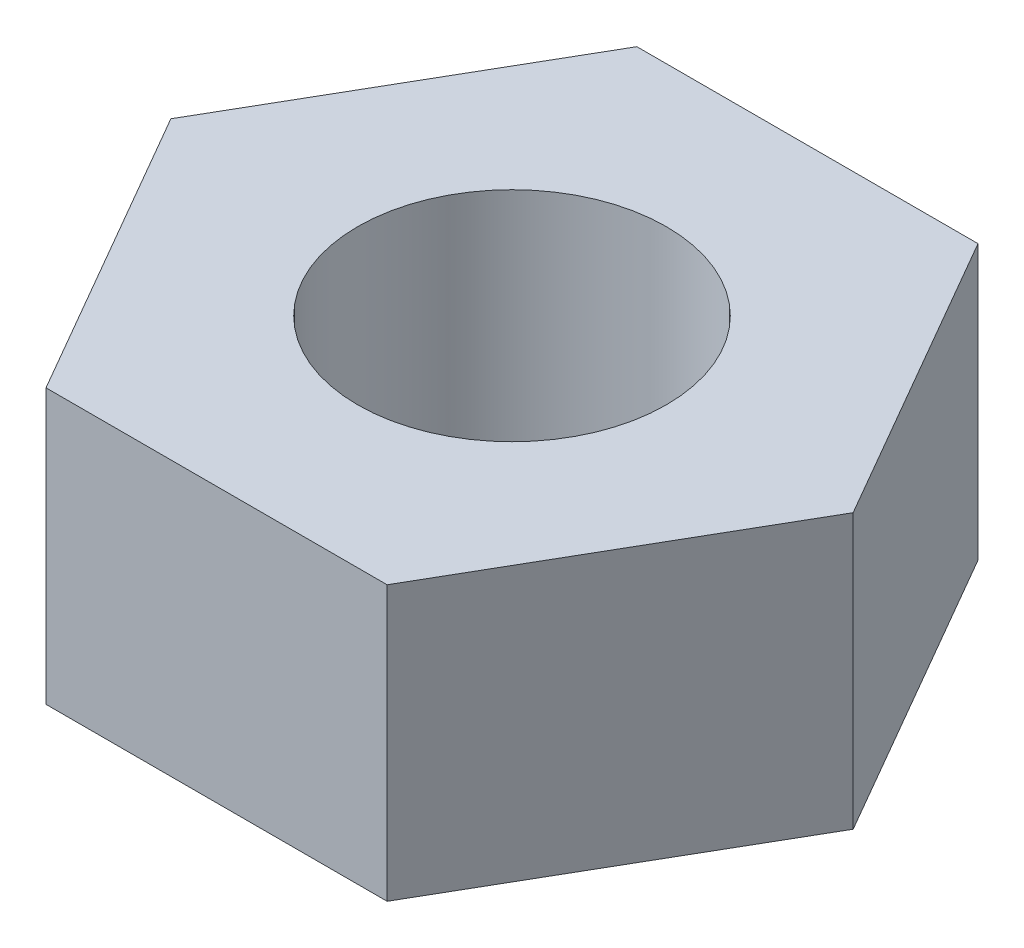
ISO-10303-21;
HEADER;
FILE_DESCRIPTION(('STEP AP214'),'2;1');
FILE_NAME('part.step','',(''),(''),'','','');
FILE_SCHEMA(('AUTOMOTIVE_DESIGN { 1 0 10303 214 1 1 1 1 }'));
ENDSEC;
DATA;
#1=APPLICATION_CONTEXT('core data for automotive mechanical design processes');
#2=APPLICATION_PROTOCOL_DEFINITION('international standard','automotive_design',2000,#1);
#3=PRODUCT_CONTEXT('',#1,'mechanical');
#4=PRODUCT('Part','Part','',(#3));
#5=PRODUCT_RELATED_PRODUCT_CATEGORY('part','',(#4));
#6=PRODUCT_DEFINITION_FORMATION('','',#4);
#7=PRODUCT_DEFINITION_CONTEXT('part definition',#1,'design');
#8=PRODUCT_DEFINITION('design','',#6,#7);
#9=PRODUCT_DEFINITION_SHAPE('','',#8);
#10=(LENGTH_UNIT() NAMED_UNIT(*) SI_UNIT(.MILLI.,.METRE.));
#11=(NAMED_UNIT(*) PLANE_ANGLE_UNIT() SI_UNIT($,.RADIAN.));
#12=(NAMED_UNIT(*) SI_UNIT($,.STERADIAN.) SOLID_ANGLE_UNIT());
#13=UNCERTAINTY_MEASURE_WITH_UNIT(LENGTH_MEASURE(1.E-05),#10,'distance_accuracy_value','');
#14=(GEOMETRIC_REPRESENTATION_CONTEXT(3) GLOBAL_UNCERTAINTY_ASSIGNED_CONTEXT((#13)) GLOBAL_UNIT_ASSIGNED_CONTEXT((#10,
#11,#12)) REPRESENTATION_CONTEXT('',''));
#15=CARTESIAN_POINT('',(0.,0.,0.));
#16=DIRECTION('',(0.,0.,1.));
#17=DIRECTION('',(1.,0.,0.));
#18=AXIS2_PLACEMENT_3D('',#15,#16,#17);
#19=CARTESIAN_POINT('',(1.62778134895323,2.6162,2.8194));
#20=DIRECTION('',(-0.866025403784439,0.,-0.5));
#21=DIRECTION('',(-0.5,0.,0.866025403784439));
#22=AXIS2_PLACEMENT_3D('',#19,#20,#21);
#23=PLANE('',#22);
#24=DIRECTION('',(0.5,0.,-0.866025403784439));
#25=VECTOR('',#24,1.);
#26=CARTESIAN_POINT('',(1.62778134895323,0.,2.8194));
#27=LINE('',#26,#25);
#28=CARTESIAN_POINT('',(1.62778134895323,0.,2.8194));
#29=VERTEX_POINT('',#28);
#30=CARTESIAN_POINT('',(3.25556269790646,0.,0.));
#31=VERTEX_POINT('',#30);
#32=EDGE_CURVE('E116',#29,#31,#27,.T.);
#33=ORIENTED_EDGE('',*,*,#32,.T.);
#34=DIRECTION('',(0.,-1.,0.));
#35=VECTOR('',#34,1.);
#36=CARTESIAN_POINT('',(3.25556269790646,2.6162,0.));
#37=LINE('',#36,#35);
#38=CARTESIAN_POINT('',(3.25556269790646,2.6162,0.));
#39=VERTEX_POINT('',#38);
#40=EDGE_CURVE('E11',#39,#31,#37,.T.);
#41=ORIENTED_EDGE('',*,*,#40,.F.);
#42=DIRECTION('',(0.5,0.,-0.866025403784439));
#43=VECTOR('',#42,1.);
#44=CARTESIAN_POINT('',(1.62778134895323,2.6162,2.8194));
#45=LINE('',#44,#43);
#46=CARTESIAN_POINT('',(1.62778134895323,2.6162,2.8194));
#47=VERTEX_POINT('',#46);
#48=EDGE_CURVE('E127',#47,#39,#45,.T.);
#49=ORIENTED_EDGE('',*,*,#48,.F.);
#50=DIRECTION('',(0.,-1.,0.));
#51=VECTOR('',#50,1.);
#52=CARTESIAN_POINT('',(1.62778134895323,2.6162,2.8194));
#53=LINE('',#52,#51);
#54=EDGE_CURVE('E112',#47,#29,#53,.T.);
#55=ORIENTED_EDGE('',*,*,#54,.T.);
#56=EDGE_LOOP('',(#33,#41,#49,#55));
#57=FACE_BOUND('',#56,.T.);
#58=ADVANCED_FACE('F32',(#57),#23,.F.);
#59=CARTESIAN_POINT('',(3.25556269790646,2.6162,0.));
#60=DIRECTION('',(-0.866025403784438,0.,0.5));
#61=DIRECTION('',(0.5,0.,0.866025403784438));
#62=AXIS2_PLACEMENT_3D('',#59,#60,#61);
#63=PLANE('',#62);
#64=DIRECTION('',(-0.5,0.,-0.866025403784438));
#65=VECTOR('',#64,1.);
#66=CARTESIAN_POINT('',(3.25556269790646,0.,0.));
#67=LINE('',#66,#65);
#68=CARTESIAN_POINT('',(1.62778134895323,0.,-2.8194));
#69=VERTEX_POINT('',#68);
#70=EDGE_CURVE('E119',#31,#69,#67,.T.);
#71=ORIENTED_EDGE('',*,*,#70,.T.);
#72=DIRECTION('',(0.,-1.,0.));
#73=VECTOR('',#72,1.);
#74=CARTESIAN_POINT('',(1.62778134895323,2.6162,-2.8194));
#75=LINE('',#74,#73);
#76=CARTESIAN_POINT('',(1.62778134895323,2.6162,-2.8194));
#77=VERTEX_POINT('',#76);
#78=EDGE_CURVE('E40',#77,#69,#75,.T.);
#79=ORIENTED_EDGE('',*,*,#78,.F.);
#80=DIRECTION('',(-0.5,0.,-0.866025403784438));
#81=VECTOR('',#80,1.);
#82=CARTESIAN_POINT('',(3.25556269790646,2.6162,0.));
#83=LINE('',#82,#81);
#84=EDGE_CURVE('E85',#39,#77,#83,.T.);
#85=ORIENTED_EDGE('',*,*,#84,.F.);
#86=ORIENTED_EDGE('',*,*,#40,.T.);
#87=EDGE_LOOP('',(#71,#79,#85,#86));
#88=FACE_BOUND('',#87,.T.);
#89=ADVANCED_FACE('F152',(#88),#63,.F.);
#90=CARTESIAN_POINT('',(1.62778134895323,2.6162,-2.8194));
#91=DIRECTION('',(0.,0.,1.));
#92=DIRECTION('',(1.,0.,0.));
#93=AXIS2_PLACEMENT_3D('',#90,#91,#92);
#94=PLANE('',#93);
#95=DIRECTION('',(-1.,0.,0.));
#96=VECTOR('',#95,1.);
#97=CARTESIAN_POINT('',(1.62778134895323,0.,-2.8194));
#98=LINE('',#97,#96);
#99=CARTESIAN_POINT('',(-1.62778134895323,0.,-2.8194));
#100=VERTEX_POINT('',#99);
#101=EDGE_CURVE('E122',#69,#100,#98,.T.);
#102=ORIENTED_EDGE('',*,*,#101,.T.);
#103=DIRECTION('',(0.,-1.,0.));
#104=VECTOR('',#103,1.);
#105=CARTESIAN_POINT('',(-1.62778134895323,2.6162,-2.8194));
#106=LINE('',#105,#104);
#107=CARTESIAN_POINT('',(-1.62778134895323,2.6162,-2.8194));
#108=VERTEX_POINT('',#107);
#109=EDGE_CURVE('E107',#108,#100,#106,.T.);
#110=ORIENTED_EDGE('',*,*,#109,.F.);
#111=DIRECTION('',(-1.,0.,0.));
#112=VECTOR('',#111,1.);
#113=CARTESIAN_POINT('',(1.62778134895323,2.6162,-2.8194));
#114=LINE('',#113,#112);
#115=EDGE_CURVE('E98',#77,#108,#114,.T.);
#116=ORIENTED_EDGE('',*,*,#115,.F.);
#117=ORIENTED_EDGE('',*,*,#78,.T.);
#118=EDGE_LOOP('',(#102,#110,#116,#117));
#119=FACE_BOUND('',#118,.T.);
#120=ADVANCED_FACE('F133',(#119),#94,.F.);
#121=CARTESIAN_POINT('',(-1.62778134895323,2.6162,-2.8194));
#122=DIRECTION('',(0.866025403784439,0.,0.5));
#123=DIRECTION('',(0.5,0.,-0.866025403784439));
#124=AXIS2_PLACEMENT_3D('',#121,#122,#123);
#125=PLANE('',#124);
#126=DIRECTION('',(-0.5,0.,0.866025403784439));
#127=VECTOR('',#126,1.);
#128=CARTESIAN_POINT('',(-1.62778134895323,0.,-2.8194));
#129=LINE('',#128,#127);
#130=CARTESIAN_POINT('',(-3.25556269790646,0.,0.));
#131=VERTEX_POINT('',#130);
#132=EDGE_CURVE('E106',#100,#131,#129,.T.);
#133=ORIENTED_EDGE('',*,*,#132,.T.);
#134=DIRECTION('',(0.,-1.,0.));
#135=VECTOR('',#134,1.);
#136=CARTESIAN_POINT('',(-3.25556269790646,2.6162,0.));
#137=LINE('',#136,#135);
#138=CARTESIAN_POINT('',(-3.25556269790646,2.6162,0.));
#139=VERTEX_POINT('',#138);
#140=EDGE_CURVE('E103',#139,#131,#137,.T.);
#141=ORIENTED_EDGE('',*,*,#140,.F.);
#142=DIRECTION('',(-0.5,0.,0.866025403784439));
#143=VECTOR('',#142,1.);
#144=CARTESIAN_POINT('',(-1.62778134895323,2.6162,-2.8194));
#145=LINE('',#144,#143);
#146=EDGE_CURVE('E92',#108,#139,#145,.T.);
#147=ORIENTED_EDGE('',*,*,#146,.F.);
#148=ORIENTED_EDGE('',*,*,#109,.T.);
#149=EDGE_LOOP('',(#133,#141,#147,#148));
#150=FACE_BOUND('',#149,.T.);
#151=ADVANCED_FACE('F104',(#150),#125,.F.);
#152=CARTESIAN_POINT('',(-3.25556269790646,2.6162,0.));
#153=DIRECTION('',(0.866025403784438,0.,-0.5));
#154=DIRECTION('',(-0.5,0.,-0.866025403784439));
#155=AXIS2_PLACEMENT_3D('',#152,#153,#154);
#156=PLANE('',#155);
#157=DIRECTION('',(0.5,0.,0.866025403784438));
#158=VECTOR('',#157,1.);
#159=CARTESIAN_POINT('',(-3.25556269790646,0.,0.));
#160=LINE('',#159,#158);
#161=CARTESIAN_POINT('',(-1.62778134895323,0.,2.8194));
#162=VERTEX_POINT('',#161);
#163=EDGE_CURVE('E71',#131,#162,#160,.T.);
#164=ORIENTED_EDGE('',*,*,#163,.T.);
#165=DIRECTION('',(0.,-1.,0.));
#166=VECTOR('',#165,1.);
#167=CARTESIAN_POINT('',(-1.62778134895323,2.6162,2.8194));
#168=LINE('',#167,#166);
#169=CARTESIAN_POINT('',(-1.62778134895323,2.6162,2.8194));
#170=VERTEX_POINT('',#169);
#171=EDGE_CURVE('E108',#170,#162,#168,.T.);
#172=ORIENTED_EDGE('',*,*,#171,.F.);
#173=DIRECTION('',(0.5,0.,0.866025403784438));
#174=VECTOR('',#173,1.);
#175=CARTESIAN_POINT('',(-3.25556269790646,2.6162,0.));
#176=LINE('',#175,#174);
#177=EDGE_CURVE('E96',#139,#170,#176,.T.);
#178=ORIENTED_EDGE('',*,*,#177,.F.);
#179=ORIENTED_EDGE('',*,*,#140,.T.);
#180=EDGE_LOOP('',(#164,#172,#178,#179));
#181=FACE_BOUND('',#180,.T.);
#182=ADVANCED_FACE('F110',(#181),#156,.F.);
#183=CARTESIAN_POINT('',(-1.62778134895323,2.6162,2.8194));
#184=DIRECTION('',(0.,0.,-1.));
#185=DIRECTION('',(-1.,0.,0.));
#186=AXIS2_PLACEMENT_3D('',#183,#184,#185);
#187=PLANE('',#186);
#188=DIRECTION('',(1.,0.,0.));
#189=VECTOR('',#188,1.);
#190=CARTESIAN_POINT('',(-1.62778134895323,0.,2.8194));
#191=LINE('',#190,#189);
#192=EDGE_CURVE('E77',#162,#29,#191,.T.);
#193=ORIENTED_EDGE('',*,*,#192,.T.);
#194=ORIENTED_EDGE('',*,*,#54,.F.);
#195=DIRECTION('',(1.,0.,0.));
#196=VECTOR('',#195,1.);
#197=CARTESIAN_POINT('',(-1.62778134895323,2.6162,2.8194));
#198=LINE('',#197,#196);
#199=EDGE_CURVE('E48',#170,#47,#198,.T.);
#200=ORIENTED_EDGE('',*,*,#199,.F.);
#201=ORIENTED_EDGE('',*,*,#171,.T.);
#202=EDGE_LOOP('',(#193,#194,#200,#201));
#203=FACE_BOUND('',#202,.T.);
#204=ADVANCED_FACE('F140',(#203),#187,.F.);
#205=CARTESIAN_POINT('',(0.,2.6162,0.));
#206=DIRECTION('',(0.,1.,0.));
#207=DIRECTION('',(0.,0.,1.));
#208=AXIS2_PLACEMENT_3D('',#205,#206,#207);
#209=PLANE('',#208);
#210=CARTESIAN_POINT('',(0.,2.6162,0.));
#211=DIRECTION('',(0.,-1.,0.));
#212=DIRECTION('',(0.,0.,-1.));
#213=AXIS2_PLACEMENT_3D('',#210,#211,#212);
#214=CIRCLE('',#213,1.4732);
#215=CARTESIAN_POINT('',(0.,2.6162,-1.4732));
#216=VERTEX_POINT('',#215);
#217=EDGE_CURVE('E120',#216,#216,#214,.T.);
#218=ORIENTED_EDGE('',*,*,#217,.T.);
#219=EDGE_LOOP('',(#218));
#220=FACE_BOUND('',#219,.T.);
#221=ORIENTED_EDGE('',*,*,#48,.T.);
#222=ORIENTED_EDGE('',*,*,#84,.T.);
#223=ORIENTED_EDGE('',*,*,#115,.T.);
#224=ORIENTED_EDGE('',*,*,#146,.T.);
#225=ORIENTED_EDGE('',*,*,#177,.T.);
#226=ORIENTED_EDGE('',*,*,#199,.T.);
#227=EDGE_LOOP('',(#221,#222,#223,#224,#225,#226));
#228=FACE_BOUND('',#227,.T.);
#229=ADVANCED_FACE('F94',(#220,#228),#209,.T.);
#230=CARTESIAN_POINT('',(0.,0.,0.));
#231=DIRECTION('',(0.,1.,0.));
#232=DIRECTION('',(0.,0.,1.));
#233=AXIS2_PLACEMENT_3D('',#230,#231,#232);
#234=PLANE('',#233);
#235=CARTESIAN_POINT('',(0.,0.,0.));
#236=DIRECTION('',(0.,-1.,0.));
#237=DIRECTION('',(0.,0.,-1.));
#238=AXIS2_PLACEMENT_3D('',#235,#236,#237);
#239=CIRCLE('',#238,1.4732);
#240=CARTESIAN_POINT('',(0.,0.,-1.4732));
#241=VERTEX_POINT('',#240);
#242=EDGE_CURVE('E207',#241,#241,#239,.T.);
#243=ORIENTED_EDGE('',*,*,#242,.F.);
#244=EDGE_LOOP('',(#243));
#245=FACE_BOUND('',#244,.T.);
#246=ORIENTED_EDGE('',*,*,#32,.F.);
#247=ORIENTED_EDGE('',*,*,#192,.F.);
#248=ORIENTED_EDGE('',*,*,#163,.F.);
#249=ORIENTED_EDGE('',*,*,#132,.F.);
#250=ORIENTED_EDGE('',*,*,#101,.F.);
#251=ORIENTED_EDGE('',*,*,#70,.F.);
#252=EDGE_LOOP('',(#246,#247,#248,#249,#250,#251));
#253=FACE_BOUND('',#252,.T.);
#254=ADVANCED_FACE('F136',(#245,#253),#234,.F.);
#255=CARTESIAN_POINT('',(0.,2.6162,0.));
#256=DIRECTION('',(0.,-1.,0.));
#257=DIRECTION('',(0.,0.,-1.));
#258=AXIS2_PLACEMENT_3D('',#255,#256,#257);
#259=CYLINDRICAL_SURFACE('',#258,1.4732);
#260=ORIENTED_EDGE('',*,*,#217,.F.);
#261=EDGE_LOOP('',(#260));
#262=FACE_BOUND('',#261,.T.);
#263=ORIENTED_EDGE('',*,*,#242,.T.);
#264=EDGE_LOOP('',(#263));
#265=FACE_BOUND('',#264,.T.);
#266=ADVANCED_FACE('F189',(#262,#265),#259,.F.);
#267=CLOSED_SHELL('',(#58,#89,#120,#151,#182,#204,#229,#254,#266));
#268=MANIFOLD_SOLID_BREP('B2',#267);
#269=ADVANCED_BREP_SHAPE_REPRESENTATION('',(#18,#268),#14);
#270=SHAPE_DEFINITION_REPRESENTATION(#9,#269);
ENDSEC;
END-ISO-10303-21;
